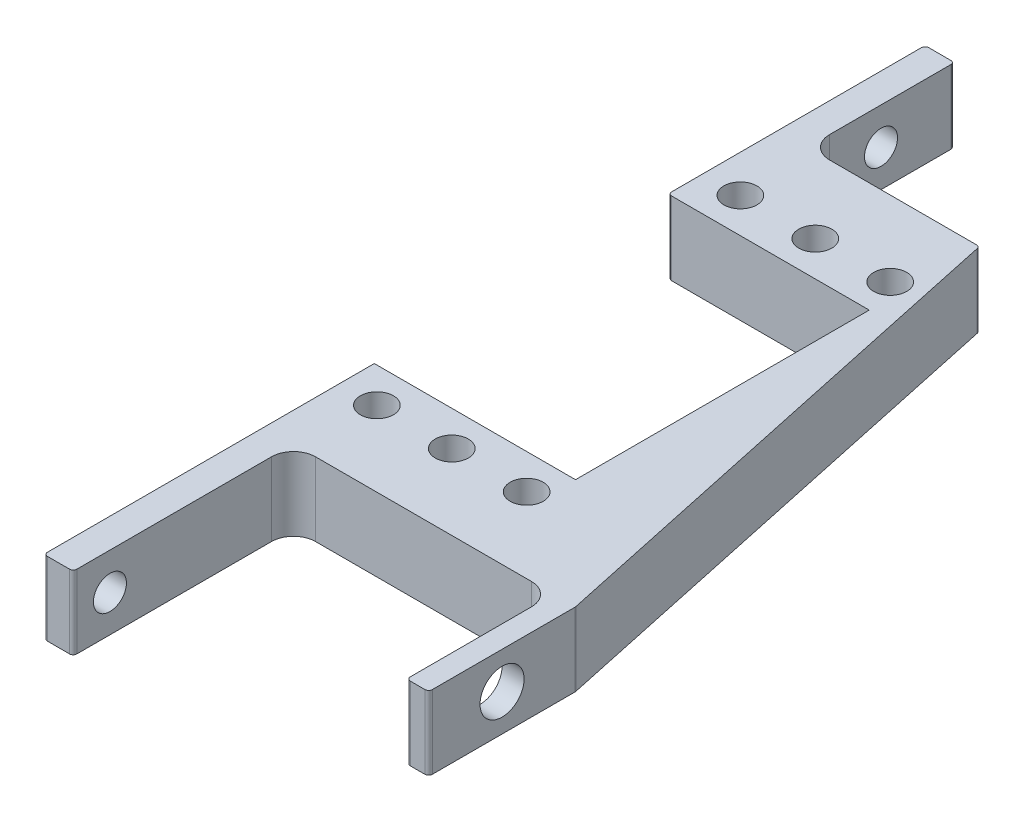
from build123d import *

# Parameters (mm, degrees)
BOSS_EXTRUDE1_DEPTH     = 10
SKETCH4_R               = 2.25
CUT_EXTRUDE2_DEPTH      = 24
LPATTERN2_COUNT         = 3
LPATTERN2_PITCH         = 10.2
SKETCH5_W               = 12
SKETCH5_H               = 10
BOSS_EXTRUDE2_DEPTH     = 20
SKETCH6_R               = 2.25
CUT_EXTRUDE3_DEPTH      = 20
SKETCH7_W               = 12
SKETCH7_H               = 10
BOSS_EXTRUDE3_DEPTH     = 30
SKETCH8_R               = 2.25
CUT_EXTRUDE4_DEPTH      = 20
MIRROR1_COPY_1_SKETCH_R = 2.25
MIRROR1_COPY_1_DEPTH    = 24
MIRROR1_COPY_2_SKETCH_R = 2.25
MIRROR1_COPY_2_DEPTH    = 24
SKETCH9_W               = 20.002119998
SKETCH9_H               = 10
CUT_EXTRUDE5_DEPTH      = 12
SKETCH10_R              = 3
CUT_EXTRUDE6_DEPTH      = 12
SKETCH11_W              = 30
SKETCH11_H              = 10
CUT_EXTRUDE7_DEPTH      = 8
SKETCH12_W              = 20
SKETCH12_H              = 10
CUT_EXTRUDE8_DEPTH      = 8
FILLET1_R               = 3
FILLET2_R               = 0.5


with BuildPart() as part:
    # Sketch2 → Boss-Extrude1 (new body)
    with BuildSketch(Plane(origin=(0, 0, 0), x_dir=(1, 0, 0), z_dir=(0, 1, 0))):
        Polygon((0, 0), (15, 0), (15, 20), (0.005624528, 90.002119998), (-27.4, 90.002119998), (-27.4, 75.002119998), (0, 75.002119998), (0, 35.002119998), (-27.4, 35.002119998), (-27.4, 20.002119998), (0, 20.002119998), align=None)
    extrude(amount=BOSS_EXTRUDE1_DEPTH)

    # Sketch4 → Cut-Extrude2 (cut)
    with BuildSketch(Plane(origin=(0, 10, 0), x_dir=(1, 0, 0), z_dir=(0, 1, 0))):
        with Locations(Location((-1.9, 30.252119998, 0), (0, 0, 270))):
            Circle(SKETCH4_R)
    cut_extrude2 = extrude(amount=-CUT_EXTRUDE2_DEPTH, mode=Mode.SUBTRACT)

    # LPattern2: Cut-Extrude2 ×3
    with Locations(*[(-i * LPATTERN2_PITCH, 0, 0) for i in range(1, LPATTERN2_COUNT)]):
        add(cut_extrude2, mode=Mode.SUBTRACT)

    # Sketch5 → Boss-Extrude2 (add)
    with BuildSketch(Plane(origin=(0, 0, -90.002119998), x_dir=(-1, 0, 0), z_dir=(0, 0, -1))):
        with Locations((21.4, 5)):
            Rectangle(SKETCH5_W, SKETCH5_H)
    extrude(amount=BOSS_EXTRUDE2_DEPTH)

    # Sketch6 → Cut-Extrude3 (cut)
    with BuildSketch(Plane(origin=(-15.4, 0, 0), x_dir=(0, 0, -1), z_dir=(1, 0, 0))):
        with Locations(Location((100.002119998, 5, 0), (0, 0, 90))):
            Circle(SKETCH6_R)
    extrude(amount=-CUT_EXTRUDE3_DEPTH, mode=Mode.SUBTRACT)

    # Sketch7 → Boss-Extrude3 (add)
    with BuildSketch(Plane.XY.offset(-20.002119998)):
        with Locations((-21.4, 5)):
            Rectangle(SKETCH7_W, SKETCH7_H)
    extrude(amount=BOSS_EXTRUDE3_DEPTH)

    # Sketch8 → Cut-Extrude4 (cut)
    with BuildSketch(Plane(origin=(-15.4, 0, 0), x_dir=(0, 0, -1), z_dir=(1, 0, 0))):
        with Locations((-4.998940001, 5)):
            Circle(SKETCH8_R)
    extrude(amount=-CUT_EXTRUDE4_DEPTH, mode=Mode.SUBTRACT)

    # Mirror1: Cut-Extrude2 across plane
    add(cut_extrude2.mirror(Plane(origin=(0, 0, -55.002119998), x_dir=(1, 0, 0), z_dir=(0, 0, -1))), mode=Mode.SUBTRACT)

    # Mirror1 copy 1 sketch → Mirror1 copy 1 (cut)
    with BuildSketch(Plane(origin=(-10.2, 10, -110.004239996), x_dir=(1, 0, 0), z_dir=(0, 1, 0))):
        with Locations((-1.9, -30.252119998)):
            Circle(MIRROR1_COPY_1_SKETCH_R)
    extrude(amount=-MIRROR1_COPY_1_DEPTH, mode=Mode.SUBTRACT)

    # Mirror1 copy 2 sketch → Mirror1 copy 2 (cut)
    with BuildSketch(Plane(origin=(-20.4, 10, -110.004239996), x_dir=(1, 0, 0), z_dir=(0, 1, 0))):
        with Locations((-1.9, -30.252119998)):
            Circle(MIRROR1_COPY_2_SKETCH_R)
    extrude(amount=-MIRROR1_COPY_2_DEPTH, mode=Mode.SUBTRACT)

    # Sketch9 → Cut-Extrude5 (cut)
    with BuildSketch(Plane.ZY):
        with Locations((-10.001059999, 5)):
            Rectangle(SKETCH9_W, SKETCH9_H)
    extrude(amount=-CUT_EXTRUDE5_DEPTH, mode=Mode.SUBTRACT)

    # Sketch10 → Cut-Extrude6 (cut)
    with BuildSketch(Plane(origin=(15, 0, 0), x_dir=(0, 0, -1), z_dir=(1, 0, 0))):
        with Locations((10, 5)):
            Circle(SKETCH10_R)
    extrude(amount=-CUT_EXTRUDE6_DEPTH, mode=Mode.SUBTRACT)

    # Sketch11 → Cut-Extrude7 (cut)
    with BuildSketch(Plane(origin=(-15.4, 0, 0), x_dir=(0, 0, -1), z_dir=(1, 0, 0))):
        with Locations((5.002119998, 5)):
            Rectangle(SKETCH11_W, SKETCH11_H)
    extrude(amount=-CUT_EXTRUDE7_DEPTH, mode=Mode.SUBTRACT)

    # Sketch12 → Cut-Extrude8 (cut)
    with BuildSketch(Plane(origin=(-15.4, 0, 0), x_dir=(0, 0, -1), z_dir=(1, 0, 0))):
        with Locations((100.002119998, 5)):
            Rectangle(SKETCH12_W, SKETCH12_H)
    extrude(amount=-CUT_EXTRUDE8_DEPTH, mode=Mode.SUBTRACT)

    # Fillet1
    fillet1_edges = [part.edges().sort_by_distance(p)[0] for p in [
        (12, 5, -20.002119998),
        (-23.4, 5, -20.002119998),
        (-23.4, 5, -90.002119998),
    ]]
    fillet(fillet1_edges, radius=FILLET1_R)

    # Fillet2
    fillet2_edges = [part.edges().sort_by_distance(p)[0] for p in [
        (12, 5, 0),
        (-23.4, 5, 9.997880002),
        (-23.4, 5, -110.002119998),
        (-27.4, 5, -75.002119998),
        (0.005624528, 5, -90.002119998),
        (15, 5, -20),
        (15, 5, 0),
        (-27.4, 5, -110.002119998),
        (-27.4, 5, 9.997880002),
    ]]
    fillet(fillet2_edges, radius=FILLET2_R)


solid = part.part
